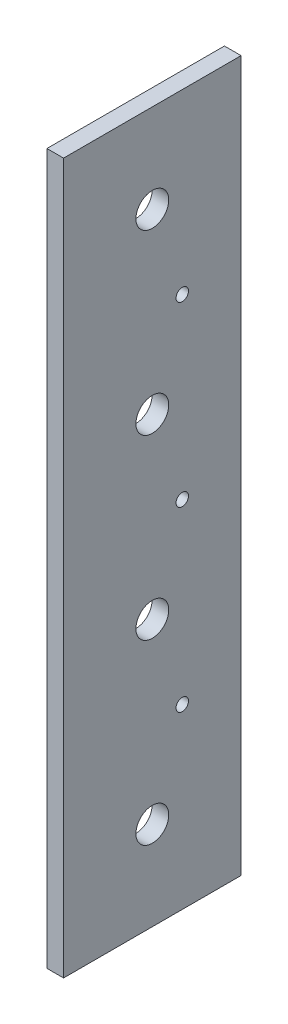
ISO-10303-21;
HEADER;
FILE_DESCRIPTION(('STEP AP214'),'2;1');
FILE_NAME('part.step','',(''),(''),'','','');
FILE_SCHEMA(('AUTOMOTIVE_DESIGN { 1 0 10303 214 1 1 1 1 }'));
ENDSEC;
DATA;
#1=APPLICATION_CONTEXT('core data for automotive mechanical design processes');
#2=APPLICATION_PROTOCOL_DEFINITION('international standard','automotive_design',2000,#1);
#3=PRODUCT_CONTEXT('',#1,'mechanical');
#4=PRODUCT('Part','Part','',(#3));
#5=PRODUCT_RELATED_PRODUCT_CATEGORY('part','',(#4));
#6=PRODUCT_DEFINITION_FORMATION('','',#4);
#7=PRODUCT_DEFINITION_CONTEXT('part definition',#1,'design');
#8=PRODUCT_DEFINITION('design','',#6,#7);
#9=PRODUCT_DEFINITION_SHAPE('','',#8);
#10=(LENGTH_UNIT() NAMED_UNIT(*) SI_UNIT(.MILLI.,.METRE.));
#11=(NAMED_UNIT(*) PLANE_ANGLE_UNIT() SI_UNIT($,.RADIAN.));
#12=(NAMED_UNIT(*) SI_UNIT($,.STERADIAN.) SOLID_ANGLE_UNIT());
#13=UNCERTAINTY_MEASURE_WITH_UNIT(LENGTH_MEASURE(1.E-05),#10,'distance_accuracy_value','');
#14=(GEOMETRIC_REPRESENTATION_CONTEXT(3) GLOBAL_UNCERTAINTY_ASSIGNED_CONTEXT((#13)) GLOBAL_UNIT_ASSIGNED_CONTEXT((#10,
#11,#12)) REPRESENTATION_CONTEXT('',''));
#15=CARTESIAN_POINT('',(0.,0.,0.));
#16=DIRECTION('',(0.,0.,1.));
#17=DIRECTION('',(1.,0.,0.));
#18=AXIS2_PLACEMENT_3D('',#15,#16,#17);
#19=CARTESIAN_POINT('',(4.7625,-101.6,-25.4));
#20=DIRECTION('',(0.,0.,1.));
#21=DIRECTION('',(1.,0.,0.));
#22=AXIS2_PLACEMENT_3D('',#19,#20,#21);
#23=PLANE('',#22);
#24=DIRECTION('',(0.,1.,0.));
#25=VECTOR('',#24,1.);
#26=CARTESIAN_POINT('',(0.,-101.6,-25.4));
#27=LINE('',#26,#25);
#28=CARTESIAN_POINT('',(0.,-101.6,-25.4));
#29=VERTEX_POINT('',#28);
#30=CARTESIAN_POINT('',(0.,101.6,-25.4));
#31=VERTEX_POINT('',#30);
#32=EDGE_CURVE('E98',#29,#31,#27,.T.);
#33=ORIENTED_EDGE('',*,*,#32,.T.);
#34=DIRECTION('',(-1.,0.,0.));
#35=VECTOR('',#34,1.);
#36=CARTESIAN_POINT('',(4.7625,101.6,-25.4));
#37=LINE('',#36,#35);
#38=CARTESIAN_POINT('',(4.7625,101.6,-25.4));
#39=VERTEX_POINT('',#38);
#40=EDGE_CURVE('E11',#39,#31,#37,.T.);
#41=ORIENTED_EDGE('',*,*,#40,.F.);
#42=DIRECTION('',(0.,1.,0.));
#43=VECTOR('',#42,1.);
#44=CARTESIAN_POINT('',(4.7625,-101.6,-25.4));
#45=LINE('',#44,#43);
#46=CARTESIAN_POINT('',(4.7625,-101.6,-25.4));
#47=VERTEX_POINT('',#46);
#48=EDGE_CURVE('E86',#47,#39,#45,.T.);
#49=ORIENTED_EDGE('',*,*,#48,.F.);
#50=DIRECTION('',(-1.,0.,0.));
#51=VECTOR('',#50,1.);
#52=CARTESIAN_POINT('',(4.7625,-101.6,-25.4));
#53=LINE('',#52,#51);
#54=EDGE_CURVE('E94',#47,#29,#53,.T.);
#55=ORIENTED_EDGE('',*,*,#54,.T.);
#56=EDGE_LOOP('',(#33,#41,#49,#55));
#57=FACE_BOUND('',#56,.T.);
#58=ADVANCED_FACE('F35',(#57),#23,.F.);
#59=CARTESIAN_POINT('',(4.7625,101.6,25.4));
#60=DIRECTION('',(0.,-1.,0.));
#61=DIRECTION('',(0.,0.,-1.));
#62=AXIS2_PLACEMENT_3D('',#59,#60,#61);
#63=PLANE('',#62);
#64=DIRECTION('',(0.,0.,1.));
#65=VECTOR('',#64,1.);
#66=CARTESIAN_POINT('',(0.,101.6,25.4));
#67=LINE('',#66,#65);
#68=CARTESIAN_POINT('',(0.,101.6,25.4));
#69=VERTEX_POINT('',#68);
#70=EDGE_CURVE('E90',#31,#69,#67,.T.);
#71=ORIENTED_EDGE('',*,*,#70,.T.);
#72=DIRECTION('',(-1.,0.,0.));
#73=VECTOR('',#72,1.);
#74=CARTESIAN_POINT('',(4.7625,101.6,25.4));
#75=LINE('',#74,#73);
#76=CARTESIAN_POINT('',(4.7625,101.6,25.4));
#77=VERTEX_POINT('',#76);
#78=EDGE_CURVE('E43',#77,#69,#75,.T.);
#79=ORIENTED_EDGE('',*,*,#78,.F.);
#80=DIRECTION('',(0.,0.,1.));
#81=VECTOR('',#80,1.);
#82=CARTESIAN_POINT('',(4.7625,101.6,25.4));
#83=LINE('',#82,#81);
#84=EDGE_CURVE('E81',#39,#77,#83,.T.);
#85=ORIENTED_EDGE('',*,*,#84,.F.);
#86=ORIENTED_EDGE('',*,*,#40,.T.);
#87=EDGE_LOOP('',(#71,#79,#85,#86));
#88=FACE_BOUND('',#87,.T.);
#89=ADVANCED_FACE('F89',(#88),#63,.F.);
#90=CARTESIAN_POINT('',(4.7625,-101.6,25.4));
#91=DIRECTION('',(0.,0.,-1.));
#92=DIRECTION('',(0.,1.,0.));
#93=AXIS2_PLACEMENT_3D('',#90,#91,#92);
#94=PLANE('',#93);
#95=DIRECTION('',(0.,-1.,0.));
#96=VECTOR('',#95,1.);
#97=CARTESIAN_POINT('',(0.,-101.6,25.4));
#98=LINE('',#97,#96);
#99=CARTESIAN_POINT('',(0.,-101.6,25.4));
#100=VERTEX_POINT('',#99);
#101=EDGE_CURVE('E68',#69,#100,#98,.T.);
#102=ORIENTED_EDGE('',*,*,#101,.T.);
#103=DIRECTION('',(-1.,0.,0.));
#104=VECTOR('',#103,1.);
#105=CARTESIAN_POINT('',(4.7625,-101.6,25.4));
#106=LINE('',#105,#104);
#107=CARTESIAN_POINT('',(4.7625,-101.6,25.4));
#108=VERTEX_POINT('',#107);
#109=EDGE_CURVE('E91',#108,#100,#106,.T.);
#110=ORIENTED_EDGE('',*,*,#109,.F.);
#111=DIRECTION('',(0.,-1.,0.));
#112=VECTOR('',#111,1.);
#113=CARTESIAN_POINT('',(4.7625,-101.6,25.4));
#114=LINE('',#113,#112);
#115=EDGE_CURVE('E84',#77,#108,#114,.T.);
#116=ORIENTED_EDGE('',*,*,#115,.F.);
#117=ORIENTED_EDGE('',*,*,#78,.T.);
#118=EDGE_LOOP('',(#102,#110,#116,#117));
#119=FACE_BOUND('',#118,.T.);
#120=ADVANCED_FACE('F92',(#119),#94,.F.);
#121=CARTESIAN_POINT('',(4.7625,-101.6,25.4));
#122=DIRECTION('',(0.,1.,0.));
#123=DIRECTION('',(0.,0.,1.));
#124=AXIS2_PLACEMENT_3D('',#121,#122,#123);
#125=PLANE('',#124);
#126=DIRECTION('',(0.,0.,-1.));
#127=VECTOR('',#126,1.);
#128=CARTESIAN_POINT('',(0.,-101.6,25.4));
#129=LINE('',#128,#127);
#130=EDGE_CURVE('E74',#100,#29,#129,.T.);
#131=ORIENTED_EDGE('',*,*,#130,.T.);
#132=ORIENTED_EDGE('',*,*,#54,.F.);
#133=DIRECTION('',(0.,0.,-1.));
#134=VECTOR('',#133,1.);
#135=CARTESIAN_POINT('',(4.7625,-101.6,25.4));
#136=LINE('',#135,#134);
#137=EDGE_CURVE('E51',#108,#47,#136,.T.);
#138=ORIENTED_EDGE('',*,*,#137,.F.);
#139=ORIENTED_EDGE('',*,*,#109,.T.);
#140=EDGE_LOOP('',(#131,#132,#138,#139));
#141=FACE_BOUND('',#140,.T.);
#142=ADVANCED_FACE('F106',(#141),#125,.F.);
#143=CARTESIAN_POINT('',(4.7625,0.,0.));
#144=DIRECTION('',(-1.,0.,0.));
#145=DIRECTION('',(0.,0.,1.));
#146=AXIS2_PLACEMENT_3D('',#143,#144,#145);
#147=PLANE('',#146);
#148=CARTESIAN_POINT('',(4.7625,-76.2000000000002,-2.54322395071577E-13));
#149=DIRECTION('',(-1.,0.,0.));
#150=DIRECTION('',(0.,0.,1.));
#151=AXIS2_PLACEMENT_3D('',#148,#149,#150);
#152=CIRCLE('',#151,4.69900000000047);
#153=CARTESIAN_POINT('',(4.7625,-76.2000000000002,4.69900000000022));
#154=VERTEX_POINT('',#153);
#155=EDGE_CURVE('E101',#154,#154,#152,.T.);
#156=ORIENTED_EDGE('',*,*,#155,.T.);
#157=EDGE_LOOP('',(#156));
#158=FACE_BOUND('',#157,.T.);
#159=CARTESIAN_POINT('',(4.7625,7.01413209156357E-11,-8.57249999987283));
#160=DIRECTION('',(-1.,0.,0.));
#161=DIRECTION('',(0.,0.,1.));
#162=AXIS2_PLACEMENT_3D('',#159,#160,#161);
#163=CIRCLE('',#162,1.77799999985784);
#164=CARTESIAN_POINT('',(4.7625,7.01413209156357E-11,-6.79450000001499));
#165=VERTEX_POINT('',#164);
#166=EDGE_CURVE('E141',#165,#165,#163,.T.);
#167=ORIENTED_EDGE('',*,*,#166,.T.);
#168=EDGE_LOOP('',(#167));
#169=FACE_BOUND('',#168,.T.);
#170=CARTESIAN_POINT('',(4.7625,50.8000000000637,-8.57249999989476));
#171=DIRECTION('',(-1.,0.,0.));
#172=DIRECTION('',(0.,0.,1.));
#173=AXIS2_PLACEMENT_3D('',#170,#171,#172);
#174=CIRCLE('',#173,1.77799999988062);
#175=CARTESIAN_POINT('',(4.7625,50.8000000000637,-6.79450000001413));
#176=VERTEX_POINT('',#175);
#177=EDGE_CURVE('E130',#176,#176,#174,.T.);
#178=ORIENTED_EDGE('',*,*,#177,.T.);
#179=EDGE_LOOP('',(#178));
#180=FACE_BOUND('',#179,.T.);
#181=CARTESIAN_POINT('',(4.7625,-25.4000000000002,-2.34045493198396E-13));
#182=DIRECTION('',(-1.,0.,0.));
#183=DIRECTION('',(0.,0.,1.));
#184=AXIS2_PLACEMENT_3D('',#181,#182,#183);
#185=CIRCLE('',#184,4.69900000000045);
#186=CARTESIAN_POINT('',(4.7625,-25.4000000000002,4.69900000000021));
#187=VERTEX_POINT('',#186);
#188=EDGE_CURVE('E122',#187,#187,#185,.T.);
#189=ORIENTED_EDGE('',*,*,#188,.T.);
#190=EDGE_LOOP('',(#189));
#191=FACE_BOUND('',#190,.T.);
#192=CARTESIAN_POINT('',(4.7625,25.3999999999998,-2.13768591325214E-13));
#193=DIRECTION('',(-1.,0.,0.));
#194=DIRECTION('',(0.,0.,1.));
#195=AXIS2_PLACEMENT_3D('',#192,#193,#194);
#196=CIRCLE('',#195,4.69900000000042);
#197=CARTESIAN_POINT('',(4.7625,25.3999999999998,4.69900000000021));
#198=VERTEX_POINT('',#197);
#199=EDGE_CURVE('E115',#198,#198,#196,.T.);
#200=ORIENTED_EDGE('',*,*,#199,.T.);
#201=EDGE_LOOP('',(#200));
#202=FACE_BOUND('',#201,.T.);
#203=CARTESIAN_POINT('',(4.7625,76.1999999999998,-1.94289029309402E-13));
#204=DIRECTION('',(-1.,0.,0.));
#205=DIRECTION('',(0.,0.,1.));
#206=AXIS2_PLACEMENT_3D('',#203,#204,#205);
#207=CIRCLE('',#206,4.69900000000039);
#208=CARTESIAN_POINT('',(4.7625,76.1999999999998,4.69900000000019));
#209=VERTEX_POINT('',#208);
#210=EDGE_CURVE('E116',#209,#209,#207,.T.);
#211=ORIENTED_EDGE('',*,*,#210,.T.);
#212=EDGE_LOOP('',(#211));
#213=FACE_BOUND('',#212,.T.);
#214=CARTESIAN_POINT('',(4.7625,-50.7999999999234,-8.57249999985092));
#215=DIRECTION('',(-1.,0.,0.));
#216=DIRECTION('',(0.,0.,1.));
#217=AXIS2_PLACEMENT_3D('',#214,#215,#216);
#218=CIRCLE('',#217,1.77799999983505);
#219=CARTESIAN_POINT('',(4.7625,-50.7999999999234,-6.79450000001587));
#220=VERTEX_POINT('',#219);
#221=EDGE_CURVE('E129',#220,#220,#218,.T.);
#222=ORIENTED_EDGE('',*,*,#221,.T.);
#223=EDGE_LOOP('',(#222));
#224=FACE_BOUND('',#223,.T.);
#225=ORIENTED_EDGE('',*,*,#48,.T.);
#226=ORIENTED_EDGE('',*,*,#84,.T.);
#227=ORIENTED_EDGE('',*,*,#115,.T.);
#228=ORIENTED_EDGE('',*,*,#137,.T.);
#229=EDGE_LOOP('',(#225,#226,#227,#228));
#230=FACE_BOUND('',#229,.T.);
#231=ADVANCED_FACE('F82',(#158,#169,#180,#191,#202,#213,#224,#230),#147,.F.);
#232=CARTESIAN_POINT('',(0.,0.,0.));
#233=DIRECTION('',(-1.,0.,0.));
#234=DIRECTION('',(0.,0.,1.));
#235=AXIS2_PLACEMENT_3D('',#232,#233,#234);
#236=PLANE('',#235);
#237=CARTESIAN_POINT('',(0.,-76.2000000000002,-2.54322395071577E-13));
#238=DIRECTION('',(-1.,0.,0.));
#239=DIRECTION('',(0.,0.,1.));
#240=AXIS2_PLACEMENT_3D('',#237,#238,#239);
#241=CIRCLE('',#240,4.69900000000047);
#242=CARTESIAN_POINT('',(0.,-76.2000000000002,4.69900000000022));
#243=VERTEX_POINT('',#242);
#244=EDGE_CURVE('E125',#243,#243,#241,.T.);
#245=ORIENTED_EDGE('',*,*,#244,.F.);
#246=EDGE_LOOP('',(#245));
#247=FACE_BOUND('',#246,.T.);
#248=CARTESIAN_POINT('',(0.,7.01413209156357E-11,-8.57249999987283));
#249=DIRECTION('',(-1.,0.,0.));
#250=DIRECTION('',(0.,0.,1.));
#251=AXIS2_PLACEMENT_3D('',#248,#249,#250);
#252=CIRCLE('',#251,1.77799999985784);
#253=CARTESIAN_POINT('',(0.,7.01413209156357E-11,-6.79450000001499));
#254=VERTEX_POINT('',#253);
#255=EDGE_CURVE('E138',#254,#254,#252,.T.);
#256=ORIENTED_EDGE('',*,*,#255,.F.);
#257=EDGE_LOOP('',(#256));
#258=FACE_BOUND('',#257,.T.);
#259=CARTESIAN_POINT('',(0.,50.8000000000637,-8.57249999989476));
#260=DIRECTION('',(-1.,0.,0.));
#261=DIRECTION('',(0.,0.,1.));
#262=AXIS2_PLACEMENT_3D('',#259,#260,#261);
#263=CIRCLE('',#262,1.77799999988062);
#264=CARTESIAN_POINT('',(0.,50.8000000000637,-6.79450000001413));
#265=VERTEX_POINT('',#264);
#266=EDGE_CURVE('E144',#265,#265,#263,.T.);
#267=ORIENTED_EDGE('',*,*,#266,.F.);
#268=EDGE_LOOP('',(#267));
#269=FACE_BOUND('',#268,.T.);
#270=CARTESIAN_POINT('',(0.,-25.4000000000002,-2.34045493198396E-13));
#271=DIRECTION('',(-1.,0.,0.));
#272=DIRECTION('',(0.,0.,1.));
#273=AXIS2_PLACEMENT_3D('',#270,#271,#272);
#274=CIRCLE('',#273,4.69900000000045);
#275=CARTESIAN_POINT('',(0.,-25.4000000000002,4.69900000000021));
#276=VERTEX_POINT('',#275);
#277=EDGE_CURVE('E119',#276,#276,#274,.T.);
#278=ORIENTED_EDGE('',*,*,#277,.F.);
#279=EDGE_LOOP('',(#278));
#280=FACE_BOUND('',#279,.T.);
#281=CARTESIAN_POINT('',(0.,25.3999999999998,-2.13768591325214E-13));
#282=DIRECTION('',(-1.,0.,0.));
#283=DIRECTION('',(0.,0.,1.));
#284=AXIS2_PLACEMENT_3D('',#281,#282,#283);
#285=CIRCLE('',#284,4.69900000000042);
#286=CARTESIAN_POINT('',(0.,25.3999999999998,4.69900000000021));
#287=VERTEX_POINT('',#286);
#288=EDGE_CURVE('E112',#287,#287,#285,.T.);
#289=ORIENTED_EDGE('',*,*,#288,.F.);
#290=EDGE_LOOP('',(#289));
#291=FACE_BOUND('',#290,.T.);
#292=CARTESIAN_POINT('',(0.,76.1999999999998,-1.94289029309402E-13));
#293=DIRECTION('',(-1.,0.,0.));
#294=DIRECTION('',(0.,0.,1.));
#295=AXIS2_PLACEMENT_3D('',#292,#293,#294);
#296=CIRCLE('',#295,4.69900000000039);
#297=CARTESIAN_POINT('',(0.,76.1999999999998,4.69900000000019));
#298=VERTEX_POINT('',#297);
#299=EDGE_CURVE('E133',#298,#298,#296,.T.);
#300=ORIENTED_EDGE('',*,*,#299,.F.);
#301=EDGE_LOOP('',(#300));
#302=FACE_BOUND('',#301,.T.);
#303=CARTESIAN_POINT('',(0.,-50.7999999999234,-8.57249999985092));
#304=DIRECTION('',(-1.,0.,0.));
#305=DIRECTION('',(0.,0.,1.));
#306=AXIS2_PLACEMENT_3D('',#303,#304,#305);
#307=CIRCLE('',#306,1.77799999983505);
#308=CARTESIAN_POINT('',(0.,-50.7999999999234,-6.79450000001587));
#309=VERTEX_POINT('',#308);
#310=EDGE_CURVE('E126',#309,#309,#307,.T.);
#311=ORIENTED_EDGE('',*,*,#310,.F.);
#312=EDGE_LOOP('',(#311));
#313=FACE_BOUND('',#312,.T.);
#314=ORIENTED_EDGE('',*,*,#32,.F.);
#315=ORIENTED_EDGE('',*,*,#130,.F.);
#316=ORIENTED_EDGE('',*,*,#101,.F.);
#317=ORIENTED_EDGE('',*,*,#70,.F.);
#318=EDGE_LOOP('',(#314,#315,#316,#317));
#319=FACE_BOUND('',#318,.T.);
#320=ADVANCED_FACE('F109',(#247,#258,#269,#280,#291,#302,#313,#319),#236,.T.);
#321=CARTESIAN_POINT('',(4.7625,-50.7999999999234,-8.57249999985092));
#322=DIRECTION('',(-1.,0.,0.));
#323=DIRECTION('',(0.,0.,1.));
#324=AXIS2_PLACEMENT_3D('',#321,#322,#323);
#325=CYLINDRICAL_SURFACE('',#324,1.77799999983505);
#326=CARTESIAN_POINT('',(4.7625,-50.7999999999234,-6.79450000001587));
#327=CARTESIAN_POINT('',(4.712890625,-50.7999999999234,-6.79450000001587));
#328=CARTESIAN_POINT('',(4.66328125,-50.7999999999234,-6.79450000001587));
#329=CARTESIAN_POINT('',(4.5640625,-50.7999999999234,-6.79450000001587));
#330=CARTESIAN_POINT('',(4.514453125,-50.7999999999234,-6.79450000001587));
#331=CARTESIAN_POINT('',(4.415234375,-50.7999999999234,-6.79450000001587));
#332=CARTESIAN_POINT('',(4.365625,-50.7999999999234,-6.79450000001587));
#333=CARTESIAN_POINT('',(4.26640625,-50.7999999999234,-6.79450000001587));
#334=CARTESIAN_POINT('',(4.216796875,-50.7999999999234,-6.79450000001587));
#335=CARTESIAN_POINT('',(4.117578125,-50.7999999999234,-6.79450000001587));
#336=CARTESIAN_POINT('',(4.06796875,-50.7999999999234,-6.79450000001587));
#337=CARTESIAN_POINT('',(3.96875,-50.7999999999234,-6.79450000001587));
#338=CARTESIAN_POINT('',(3.919140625,-50.7999999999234,-6.79450000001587));
#339=CARTESIAN_POINT('',(3.819921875,-50.7999999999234,-6.79450000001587));
#340=CARTESIAN_POINT('',(3.7703125,-50.7999999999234,-6.79450000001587));
#341=CARTESIAN_POINT('',(3.67109375,-50.7999999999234,-6.79450000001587));
#342=CARTESIAN_POINT('',(3.621484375,-50.7999999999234,-6.79450000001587));
#343=CARTESIAN_POINT('',(3.522265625,-50.7999999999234,-6.79450000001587));
#344=CARTESIAN_POINT('',(3.47265625,-50.7999999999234,-6.79450000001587));
#345=CARTESIAN_POINT('',(3.3734375,-50.7999999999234,-6.79450000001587));
#346=CARTESIAN_POINT('',(3.323828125,-50.7999999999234,-6.79450000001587));
#347=CARTESIAN_POINT('',(3.224609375,-50.7999999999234,-6.79450000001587));
#348=CARTESIAN_POINT('',(3.175,-50.7999999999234,-6.79450000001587));
#349=CARTESIAN_POINT('',(3.07578125,-50.7999999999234,-6.79450000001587));
#350=CARTESIAN_POINT('',(3.026171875,-50.7999999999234,-6.79450000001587));
#351=CARTESIAN_POINT('',(2.926953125,-50.7999999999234,-6.79450000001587));
#352=CARTESIAN_POINT('',(2.87734375,-50.7999999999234,-6.79450000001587));
#353=CARTESIAN_POINT('',(2.778125,-50.7999999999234,-6.79450000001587));
#354=CARTESIAN_POINT('',(2.728515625,-50.7999999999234,-6.79450000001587));
#355=CARTESIAN_POINT('',(2.629296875,-50.7999999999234,-6.79450000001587));
#356=CARTESIAN_POINT('',(2.5796875,-50.7999999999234,-6.79450000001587));
#357=CARTESIAN_POINT('',(2.48046875,-50.7999999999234,-6.79450000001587));
#358=CARTESIAN_POINT('',(2.430859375,-50.7999999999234,-6.79450000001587));
#359=CARTESIAN_POINT('',(2.331640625,-50.7999999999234,-6.79450000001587));
#360=CARTESIAN_POINT('',(2.28203125,-50.7999999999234,-6.79450000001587));
#361=CARTESIAN_POINT('',(2.1828125,-50.7999999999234,-6.79450000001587));
#362=CARTESIAN_POINT('',(2.133203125,-50.7999999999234,-6.79450000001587));
#363=CARTESIAN_POINT('',(2.033984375,-50.7999999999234,-6.79450000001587));
#364=CARTESIAN_POINT('',(1.984375,-50.7999999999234,-6.79450000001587));
#365=CARTESIAN_POINT('',(1.88515625,-50.7999999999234,-6.79450000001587));
#366=CARTESIAN_POINT('',(1.835546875,-50.7999999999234,-6.79450000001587));
#367=CARTESIAN_POINT('',(1.736328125,-50.7999999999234,-6.79450000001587));
#368=CARTESIAN_POINT('',(1.68671875,-50.7999999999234,-6.79450000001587));
#369=CARTESIAN_POINT('',(1.5875,-50.7999999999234,-6.79450000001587));
#370=CARTESIAN_POINT('',(1.537890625,-50.7999999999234,-6.79450000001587));
#371=CARTESIAN_POINT('',(1.438671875,-50.7999999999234,-6.79450000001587));
#372=CARTESIAN_POINT('',(1.3890625,-50.7999999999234,-6.79450000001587));
#373=CARTESIAN_POINT('',(1.28984375,-50.7999999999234,-6.79450000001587));
#374=CARTESIAN_POINT('',(1.240234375,-50.7999999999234,-6.79450000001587));
#375=CARTESIAN_POINT('',(1.141015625,-50.7999999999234,-6.79450000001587));
#376=CARTESIAN_POINT('',(1.09140625,-50.7999999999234,-6.79450000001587));
#377=CARTESIAN_POINT('',(0.9921875,-50.7999999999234,-6.79450000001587));
#378=CARTESIAN_POINT('',(0.942578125,-50.7999999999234,-6.79450000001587));
#379=CARTESIAN_POINT('',(0.843359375,-50.7999999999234,-6.79450000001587));
#380=CARTESIAN_POINT('',(0.79375,-50.7999999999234,-6.79450000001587));
#381=CARTESIAN_POINT('',(0.69453125,-50.7999999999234,-6.79450000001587));
#382=CARTESIAN_POINT('',(0.644921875,-50.7999999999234,-6.79450000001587));
#383=CARTESIAN_POINT('',(0.545703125,-50.7999999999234,-6.79450000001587));
#384=CARTESIAN_POINT('',(0.49609375,-50.7999999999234,-6.79450000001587));
#385=CARTESIAN_POINT('',(0.396875,-50.7999999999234,-6.79450000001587));
#386=CARTESIAN_POINT('',(0.347265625,-50.7999999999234,-6.79450000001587));
#387=CARTESIAN_POINT('',(0.248046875,-50.7999999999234,-6.79450000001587));
#388=CARTESIAN_POINT('',(0.1984375,-50.7999999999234,-6.79450000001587));
#389=CARTESIAN_POINT('',(0.09921875,-50.7999999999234,-6.79450000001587));
#390=CARTESIAN_POINT('',(0.049609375,-50.7999999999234,-6.79450000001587));
#391=CARTESIAN_POINT('',(0.,-50.7999999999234,-6.79450000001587));
#392=B_SPLINE_CURVE_WITH_KNOTS('',3,(#326,#327,#328,#329,#330,#331,#332,#333,#334,#335,#336,
#337,#338,#339,#340,#341,#342,#343,#344,#345,#346,#347,#348,#349,#350,#351,#352,#353,#354,#355,
#356,#357,#358,#359,#360,#361,#362,#363,#364,#365,#366,#367,#368,#369,#370,#371,#372,#373,#374,
#375,#376,#377,#378,#379,#380,#381,#382,#383,#384,#385,#386,#387,#388,#389,#390,#391),
.UNSPECIFIED.,.F.,.F.,(4,2,2,2,2,2,2,2,2,2,2,2,2,2,2,2,2,2,2,2,2,2,2,2,2,2,2,2,2,2,2,2,4),(0.,
0.148828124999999,0.297656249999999,0.446484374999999,0.595312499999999,0.744140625,0.89296875,
1.041796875,1.190625,1.339453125,1.48828125,1.637109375,1.7859375,1.934765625,2.08359375,
2.232421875,2.38125,2.530078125,2.67890625,2.827734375,2.9765625,3.125390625,3.27421875,
3.423046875,3.571875,3.720703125,3.86953125,4.018359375,4.1671875,4.316015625,4.46484375,
4.613671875,4.7625),.UNSPECIFIED.);
#393=EDGE_CURVE('BSEAM165',#220,#309,#392,.T.);
#394=ORIENTED_EDGE('',*,*,#221,.F.);
#395=ORIENTED_EDGE('',*,*,#310,.T.);
#396=ORIENTED_EDGE('',*,*,#393,.T.);
#397=ORIENTED_EDGE('',*,*,#393,.F.);
#398=EDGE_LOOP('',(#394,#396,#395,#397));
#399=FACE_BOUND('',#398,.T.);
#400=ADVANCED_FACE('F165',(#399),#325,.F.);
#401=CARTESIAN_POINT('',(4.7625,76.1999999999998,-1.94289029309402E-13));
#402=DIRECTION('',(-1.,0.,0.));
#403=DIRECTION('',(0.,0.,1.));
#404=AXIS2_PLACEMENT_3D('',#401,#402,#403);
#405=CYLINDRICAL_SURFACE('',#404,4.69900000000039);
#406=CARTESIAN_POINT('',(4.7625,76.1999999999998,4.69900000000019));
#407=CARTESIAN_POINT('',(4.712890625,76.1999999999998,4.69900000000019));
#408=CARTESIAN_POINT('',(4.66328125,76.1999999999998,4.69900000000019));
#409=CARTESIAN_POINT('',(4.5640625,76.1999999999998,4.69900000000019));
#410=CARTESIAN_POINT('',(4.514453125,76.1999999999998,4.69900000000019));
#411=CARTESIAN_POINT('',(4.415234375,76.1999999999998,4.69900000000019));
#412=CARTESIAN_POINT('',(4.365625,76.1999999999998,4.69900000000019));
#413=CARTESIAN_POINT('',(4.26640625,76.1999999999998,4.69900000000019));
#414=CARTESIAN_POINT('',(4.216796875,76.1999999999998,4.69900000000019));
#415=CARTESIAN_POINT('',(4.117578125,76.1999999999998,4.69900000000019));
#416=CARTESIAN_POINT('',(4.06796875,76.1999999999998,4.69900000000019));
#417=CARTESIAN_POINT('',(3.96875,76.1999999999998,4.69900000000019));
#418=CARTESIAN_POINT('',(3.919140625,76.1999999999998,4.69900000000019));
#419=CARTESIAN_POINT('',(3.819921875,76.1999999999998,4.69900000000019));
#420=CARTESIAN_POINT('',(3.7703125,76.1999999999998,4.69900000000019));
#421=CARTESIAN_POINT('',(3.67109375,76.1999999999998,4.69900000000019));
#422=CARTESIAN_POINT('',(3.621484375,76.1999999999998,4.69900000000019));
#423=CARTESIAN_POINT('',(3.522265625,76.1999999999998,4.69900000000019));
#424=CARTESIAN_POINT('',(3.47265625,76.1999999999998,4.69900000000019));
#425=CARTESIAN_POINT('',(3.3734375,76.1999999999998,4.69900000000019));
#426=CARTESIAN_POINT('',(3.323828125,76.1999999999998,4.69900000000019));
#427=CARTESIAN_POINT('',(3.224609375,76.1999999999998,4.69900000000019));
#428=CARTESIAN_POINT('',(3.175,76.1999999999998,4.69900000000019));
#429=CARTESIAN_POINT('',(3.07578125,76.1999999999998,4.69900000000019));
#430=CARTESIAN_POINT('',(3.026171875,76.1999999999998,4.69900000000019));
#431=CARTESIAN_POINT('',(2.926953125,76.1999999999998,4.69900000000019));
#432=CARTESIAN_POINT('',(2.87734375,76.1999999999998,4.69900000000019));
#433=CARTESIAN_POINT('',(2.778125,76.1999999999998,4.69900000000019));
#434=CARTESIAN_POINT('',(2.728515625,76.1999999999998,4.69900000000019));
#435=CARTESIAN_POINT('',(2.629296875,76.1999999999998,4.69900000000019));
#436=CARTESIAN_POINT('',(2.5796875,76.1999999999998,4.69900000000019));
#437=CARTESIAN_POINT('',(2.48046875,76.1999999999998,4.69900000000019));
#438=CARTESIAN_POINT('',(2.430859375,76.1999999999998,4.69900000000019));
#439=CARTESIAN_POINT('',(2.331640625,76.1999999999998,4.69900000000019));
#440=CARTESIAN_POINT('',(2.28203125,76.1999999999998,4.69900000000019));
#441=CARTESIAN_POINT('',(2.1828125,76.1999999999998,4.69900000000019));
#442=CARTESIAN_POINT('',(2.133203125,76.1999999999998,4.69900000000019));
#443=CARTESIAN_POINT('',(2.033984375,76.1999999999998,4.69900000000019));
#444=CARTESIAN_POINT('',(1.984375,76.1999999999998,4.69900000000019));
#445=CARTESIAN_POINT('',(1.88515625,76.1999999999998,4.69900000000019));
#446=CARTESIAN_POINT('',(1.835546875,76.1999999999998,4.69900000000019));
#447=CARTESIAN_POINT('',(1.736328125,76.1999999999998,4.69900000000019));
#448=CARTESIAN_POINT('',(1.68671875,76.1999999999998,4.69900000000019));
#449=CARTESIAN_POINT('',(1.5875,76.1999999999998,4.69900000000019));
#450=CARTESIAN_POINT('',(1.537890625,76.1999999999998,4.69900000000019));
#451=CARTESIAN_POINT('',(1.438671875,76.1999999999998,4.69900000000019));
#452=CARTESIAN_POINT('',(1.3890625,76.1999999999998,4.69900000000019));
#453=CARTESIAN_POINT('',(1.28984375,76.1999999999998,4.69900000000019));
#454=CARTESIAN_POINT('',(1.240234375,76.1999999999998,4.69900000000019));
#455=CARTESIAN_POINT('',(1.141015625,76.1999999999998,4.69900000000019));
#456=CARTESIAN_POINT('',(1.09140625,76.1999999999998,4.69900000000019));
#457=CARTESIAN_POINT('',(0.9921875,76.1999999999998,4.69900000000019));
#458=CARTESIAN_POINT('',(0.942578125,76.1999999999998,4.69900000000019));
#459=CARTESIAN_POINT('',(0.843359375,76.1999999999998,4.69900000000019));
#460=CARTESIAN_POINT('',(0.79375,76.1999999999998,4.69900000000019));
#461=CARTESIAN_POINT('',(0.69453125,76.1999999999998,4.69900000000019));
#462=CARTESIAN_POINT('',(0.644921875,76.1999999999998,4.69900000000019));
#463=CARTESIAN_POINT('',(0.545703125,76.1999999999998,4.69900000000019));
#464=CARTESIAN_POINT('',(0.49609375,76.1999999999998,4.69900000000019));
#465=CARTESIAN_POINT('',(0.396875,76.1999999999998,4.69900000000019));
#466=CARTESIAN_POINT('',(0.347265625,76.1999999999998,4.69900000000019));
#467=CARTESIAN_POINT('',(0.248046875,76.1999999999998,4.69900000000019));
#468=CARTESIAN_POINT('',(0.1984375,76.1999999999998,4.69900000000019));
#469=CARTESIAN_POINT('',(0.09921875,76.1999999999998,4.69900000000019));
#470=CARTESIAN_POINT('',(0.049609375,76.1999999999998,4.69900000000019));
#471=CARTESIAN_POINT('',(0.,76.1999999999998,4.69900000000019));
#472=B_SPLINE_CURVE_WITH_KNOTS('',3,(#406,#407,#408,#409,#410,#411,#412,#413,#414,#415,#416,
#417,#418,#419,#420,#421,#422,#423,#424,#425,#426,#427,#428,#429,#430,#431,#432,#433,#434,#435,
#436,#437,#438,#439,#440,#441,#442,#443,#444,#445,#446,#447,#448,#449,#450,#451,#452,#453,#454,
#455,#456,#457,#458,#459,#460,#461,#462,#463,#464,#465,#466,#467,#468,#469,#470,#471),
.UNSPECIFIED.,.F.,.F.,(4,2,2,2,2,2,2,2,2,2,2,2,2,2,2,2,2,2,2,2,2,2,2,2,2,2,2,2,2,2,2,2,4),(0.,
0.148828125,0.29765625,0.446484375,0.5953125,0.744140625,0.892968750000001,1.041796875,1.190625,
1.339453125,1.48828125,1.637109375,1.7859375,1.934765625,2.08359375,2.232421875,2.38125,
2.530078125,2.67890625,2.827734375,2.9765625,3.125390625,3.27421875,3.423046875,3.571875,
3.720703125,3.86953125,4.018359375,4.1671875,4.316015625,4.46484375,4.613671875,4.7625),.UNSPECIFIED.);
#473=EDGE_CURVE('BSEAM180',#209,#298,#472,.T.);
#474=ORIENTED_EDGE('',*,*,#210,.F.);
#475=ORIENTED_EDGE('',*,*,#299,.T.);
#476=ORIENTED_EDGE('',*,*,#473,.T.);
#477=ORIENTED_EDGE('',*,*,#473,.F.);
#478=EDGE_LOOP('',(#474,#476,#475,#477));
#479=FACE_BOUND('',#478,.T.);
#480=ADVANCED_FACE('F180',(#479),#405,.F.);
#481=CARTESIAN_POINT('',(4.7625,25.3999999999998,-2.13768591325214E-13));
#482=DIRECTION('',(-1.,0.,0.));
#483=DIRECTION('',(0.,0.,1.));
#484=AXIS2_PLACEMENT_3D('',#481,#482,#483);
#485=CYLINDRICAL_SURFACE('',#484,4.69900000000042);
#486=CARTESIAN_POINT('',(4.7625,25.3999999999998,4.69900000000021));
#487=CARTESIAN_POINT('',(4.712890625,25.3999999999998,4.69900000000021));
#488=CARTESIAN_POINT('',(4.66328125,25.3999999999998,4.69900000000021));
#489=CARTESIAN_POINT('',(4.5640625,25.3999999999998,4.69900000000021));
#490=CARTESIAN_POINT('',(4.514453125,25.3999999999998,4.69900000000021));
#491=CARTESIAN_POINT('',(4.415234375,25.3999999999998,4.69900000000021));
#492=CARTESIAN_POINT('',(4.365625,25.3999999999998,4.69900000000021));
#493=CARTESIAN_POINT('',(4.26640625,25.3999999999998,4.69900000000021));
#494=CARTESIAN_POINT('',(4.216796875,25.3999999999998,4.69900000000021));
#495=CARTESIAN_POINT('',(4.117578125,25.3999999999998,4.69900000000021));
#496=CARTESIAN_POINT('',(4.06796875,25.3999999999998,4.69900000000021));
#497=CARTESIAN_POINT('',(3.96875,25.3999999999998,4.69900000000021));
#498=CARTESIAN_POINT('',(3.919140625,25.3999999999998,4.69900000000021));
#499=CARTESIAN_POINT('',(3.819921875,25.3999999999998,4.69900000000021));
#500=CARTESIAN_POINT('',(3.7703125,25.3999999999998,4.69900000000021));
#501=CARTESIAN_POINT('',(3.67109375,25.3999999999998,4.69900000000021));
#502=CARTESIAN_POINT('',(3.621484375,25.3999999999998,4.69900000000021));
#503=CARTESIAN_POINT('',(3.522265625,25.3999999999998,4.69900000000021));
#504=CARTESIAN_POINT('',(3.47265625,25.3999999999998,4.69900000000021));
#505=CARTESIAN_POINT('',(3.3734375,25.3999999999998,4.69900000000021));
#506=CARTESIAN_POINT('',(3.323828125,25.3999999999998,4.69900000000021));
#507=CARTESIAN_POINT('',(3.224609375,25.3999999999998,4.69900000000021));
#508=CARTESIAN_POINT('',(3.175,25.3999999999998,4.69900000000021));
#509=CARTESIAN_POINT('',(3.07578125,25.3999999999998,4.69900000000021));
#510=CARTESIAN_POINT('',(3.026171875,25.3999999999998,4.69900000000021));
#511=CARTESIAN_POINT('',(2.926953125,25.3999999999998,4.69900000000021));
#512=CARTESIAN_POINT('',(2.87734375,25.3999999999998,4.69900000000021));
#513=CARTESIAN_POINT('',(2.778125,25.3999999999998,4.69900000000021));
#514=CARTESIAN_POINT('',(2.728515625,25.3999999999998,4.69900000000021));
#515=CARTESIAN_POINT('',(2.629296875,25.3999999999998,4.69900000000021));
#516=CARTESIAN_POINT('',(2.5796875,25.3999999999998,4.69900000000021));
#517=CARTESIAN_POINT('',(2.48046875,25.3999999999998,4.69900000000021));
#518=CARTESIAN_POINT('',(2.430859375,25.3999999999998,4.69900000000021));
#519=CARTESIAN_POINT('',(2.331640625,25.3999999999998,4.69900000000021));
#520=CARTESIAN_POINT('',(2.28203125,25.3999999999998,4.69900000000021));
#521=CARTESIAN_POINT('',(2.1828125,25.3999999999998,4.69900000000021));
#522=CARTESIAN_POINT('',(2.133203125,25.3999999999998,4.69900000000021));
#523=CARTESIAN_POINT('',(2.033984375,25.3999999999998,4.69900000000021));
#524=CARTESIAN_POINT('',(1.984375,25.3999999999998,4.69900000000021));
#525=CARTESIAN_POINT('',(1.88515625,25.3999999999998,4.69900000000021));
#526=CARTESIAN_POINT('',(1.835546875,25.3999999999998,4.69900000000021));
#527=CARTESIAN_POINT('',(1.736328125,25.3999999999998,4.69900000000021));
#528=CARTESIAN_POINT('',(1.68671875,25.3999999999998,4.69900000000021));
#529=CARTESIAN_POINT('',(1.5875,25.3999999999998,4.69900000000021));
#530=CARTESIAN_POINT('',(1.537890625,25.3999999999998,4.69900000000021));
#531=CARTESIAN_POINT('',(1.438671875,25.3999999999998,4.69900000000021));
#532=CARTESIAN_POINT('',(1.3890625,25.3999999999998,4.69900000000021));
#533=CARTESIAN_POINT('',(1.28984375,25.3999999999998,4.69900000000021));
#534=CARTESIAN_POINT('',(1.240234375,25.3999999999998,4.69900000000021));
#535=CARTESIAN_POINT('',(1.141015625,25.3999999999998,4.69900000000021));
#536=CARTESIAN_POINT('',(1.09140625,25.3999999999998,4.69900000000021));
#537=CARTESIAN_POINT('',(0.9921875,25.3999999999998,4.69900000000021));
#538=CARTESIAN_POINT('',(0.942578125,25.3999999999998,4.69900000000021));
#539=CARTESIAN_POINT('',(0.843359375,25.3999999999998,4.69900000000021));
#540=CARTESIAN_POINT('',(0.79375,25.3999999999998,4.69900000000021));
#541=CARTESIAN_POINT('',(0.69453125,25.3999999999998,4.69900000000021));
#542=CARTESIAN_POINT('',(0.644921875,25.3999999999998,4.69900000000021));
#543=CARTESIAN_POINT('',(0.545703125,25.3999999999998,4.69900000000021));
#544=CARTESIAN_POINT('',(0.49609375,25.3999999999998,4.69900000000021));
#545=CARTESIAN_POINT('',(0.396875,25.3999999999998,4.69900000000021));
#546=CARTESIAN_POINT('',(0.347265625,25.3999999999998,4.69900000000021));
#547=CARTESIAN_POINT('',(0.248046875,25.3999999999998,4.69900000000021));
#548=CARTESIAN_POINT('',(0.1984375,25.3999999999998,4.69900000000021));
#549=CARTESIAN_POINT('',(0.09921875,25.3999999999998,4.69900000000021));
#550=CARTESIAN_POINT('',(0.049609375,25.3999999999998,4.69900000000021));
#551=CARTESIAN_POINT('',(0.,25.3999999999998,4.69900000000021));
#552=B_SPLINE_CURVE_WITH_KNOTS('',3,(#486,#487,#488,#489,#490,#491,#492,#493,#494,#495,#496,
#497,#498,#499,#500,#501,#502,#503,#504,#505,#506,#507,#508,#509,#510,#511,#512,#513,#514,#515,
#516,#517,#518,#519,#520,#521,#522,#523,#524,#525,#526,#527,#528,#529,#530,#531,#532,#533,#534,
#535,#536,#537,#538,#539,#540,#541,#542,#543,#544,#545,#546,#547,#548,#549,#550,#551),
.UNSPECIFIED.,.F.,.F.,(4,2,2,2,2,2,2,2,2,2,2,2,2,2,2,2,2,2,2,2,2,2,2,2,2,2,2,2,2,2,2,2,4),(0.,
0.148828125,0.29765625,0.446484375,0.5953125,0.744140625,0.892968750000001,1.041796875,1.190625,
1.339453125,1.48828125,1.637109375,1.7859375,1.934765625,2.08359375,2.232421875,2.38125,
2.530078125,2.67890625,2.827734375,2.9765625,3.125390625,3.27421875,3.423046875,3.571875,
3.720703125,3.86953125,4.018359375,4.1671875,4.316015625,4.46484375,4.613671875,4.7625),.UNSPECIFIED.);
#553=EDGE_CURVE('BSEAM187',#198,#287,#552,.T.);
#554=ORIENTED_EDGE('',*,*,#199,.F.);
#555=ORIENTED_EDGE('',*,*,#288,.T.);
#556=ORIENTED_EDGE('',*,*,#553,.T.);
#557=ORIENTED_EDGE('',*,*,#553,.F.);
#558=EDGE_LOOP('',(#554,#556,#555,#557));
#559=FACE_BOUND('',#558,.T.);
#560=ADVANCED_FACE('F187',(#559),#485,.F.);
#561=CARTESIAN_POINT('',(4.7625,-25.4000000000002,-2.34045493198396E-13));
#562=DIRECTION('',(-1.,0.,0.));
#563=DIRECTION('',(0.,0.,1.));
#564=AXIS2_PLACEMENT_3D('',#561,#562,#563);
#565=CYLINDRICAL_SURFACE('',#564,4.69900000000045);
#566=CARTESIAN_POINT('',(4.7625,-25.4000000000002,4.69900000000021));
#567=CARTESIAN_POINT('',(4.712890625,-25.4000000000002,4.69900000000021));
#568=CARTESIAN_POINT('',(4.66328125,-25.4000000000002,4.69900000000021));
#569=CARTESIAN_POINT('',(4.5640625,-25.4000000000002,4.69900000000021));
#570=CARTESIAN_POINT('',(4.514453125,-25.4000000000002,4.69900000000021));
#571=CARTESIAN_POINT('',(4.415234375,-25.4000000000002,4.69900000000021));
#572=CARTESIAN_POINT('',(4.365625,-25.4000000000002,4.69900000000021));
#573=CARTESIAN_POINT('',(4.26640625,-25.4000000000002,4.69900000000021));
#574=CARTESIAN_POINT('',(4.216796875,-25.4000000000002,4.69900000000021));
#575=CARTESIAN_POINT('',(4.117578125,-25.4000000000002,4.69900000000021));
#576=CARTESIAN_POINT('',(4.06796875,-25.4000000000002,4.69900000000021));
#577=CARTESIAN_POINT('',(3.96875,-25.4000000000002,4.69900000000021));
#578=CARTESIAN_POINT('',(3.919140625,-25.4000000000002,4.69900000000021));
#579=CARTESIAN_POINT('',(3.819921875,-25.4000000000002,4.69900000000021));
#580=CARTESIAN_POINT('',(3.7703125,-25.4000000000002,4.69900000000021));
#581=CARTESIAN_POINT('',(3.67109375,-25.4000000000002,4.69900000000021));
#582=CARTESIAN_POINT('',(3.621484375,-25.4000000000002,4.69900000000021));
#583=CARTESIAN_POINT('',(3.522265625,-25.4000000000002,4.69900000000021));
#584=CARTESIAN_POINT('',(3.47265625,-25.4000000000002,4.69900000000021));
#585=CARTESIAN_POINT('',(3.3734375,-25.4000000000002,4.69900000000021));
#586=CARTESIAN_POINT('',(3.323828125,-25.4000000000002,4.69900000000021));
#587=CARTESIAN_POINT('',(3.224609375,-25.4000000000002,4.69900000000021));
#588=CARTESIAN_POINT('',(3.175,-25.4000000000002,4.69900000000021));
#589=CARTESIAN_POINT('',(3.07578125,-25.4000000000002,4.69900000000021));
#590=CARTESIAN_POINT('',(3.026171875,-25.4000000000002,4.69900000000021));
#591=CARTESIAN_POINT('',(2.926953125,-25.4000000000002,4.69900000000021));
#592=CARTESIAN_POINT('',(2.87734375,-25.4000000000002,4.69900000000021));
#593=CARTESIAN_POINT('',(2.778125,-25.4000000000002,4.69900000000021));
#594=CARTESIAN_POINT('',(2.728515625,-25.4000000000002,4.69900000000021));
#595=CARTESIAN_POINT('',(2.629296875,-25.4000000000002,4.69900000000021));
#596=CARTESIAN_POINT('',(2.5796875,-25.4000000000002,4.69900000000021));
#597=CARTESIAN_POINT('',(2.48046875,-25.4000000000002,4.69900000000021));
#598=CARTESIAN_POINT('',(2.430859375,-25.4000000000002,4.69900000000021));
#599=CARTESIAN_POINT('',(2.331640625,-25.4000000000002,4.69900000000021));
#600=CARTESIAN_POINT('',(2.28203125,-25.4000000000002,4.69900000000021));
#601=CARTESIAN_POINT('',(2.1828125,-25.4000000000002,4.69900000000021));
#602=CARTESIAN_POINT('',(2.133203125,-25.4000000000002,4.69900000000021));
#603=CARTESIAN_POINT('',(2.033984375,-25.4000000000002,4.69900000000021));
#604=CARTESIAN_POINT('',(1.984375,-25.4000000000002,4.69900000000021));
#605=CARTESIAN_POINT('',(1.88515625,-25.4000000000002,4.69900000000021));
#606=CARTESIAN_POINT('',(1.835546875,-25.4000000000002,4.69900000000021));
#607=CARTESIAN_POINT('',(1.736328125,-25.4000000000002,4.69900000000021));
#608=CARTESIAN_POINT('',(1.68671875,-25.4000000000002,4.69900000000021));
#609=CARTESIAN_POINT('',(1.5875,-25.4000000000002,4.69900000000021));
#610=CARTESIAN_POINT('',(1.537890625,-25.4000000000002,4.69900000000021));
#611=CARTESIAN_POINT('',(1.438671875,-25.4000000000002,4.69900000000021));
#612=CARTESIAN_POINT('',(1.3890625,-25.4000000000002,4.69900000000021));
#613=CARTESIAN_POINT('',(1.28984375,-25.4000000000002,4.69900000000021));
#614=CARTESIAN_POINT('',(1.240234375,-25.4000000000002,4.69900000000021));
#615=CARTESIAN_POINT('',(1.141015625,-25.4000000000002,4.69900000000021));
#616=CARTESIAN_POINT('',(1.09140625,-25.4000000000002,4.69900000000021));
#617=CARTESIAN_POINT('',(0.9921875,-25.4000000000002,4.69900000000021));
#618=CARTESIAN_POINT('',(0.942578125,-25.4000000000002,4.69900000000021));
#619=CARTESIAN_POINT('',(0.843359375,-25.4000000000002,4.69900000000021));
#620=CARTESIAN_POINT('',(0.79375,-25.4000000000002,4.69900000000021));
#621=CARTESIAN_POINT('',(0.69453125,-25.4000000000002,4.69900000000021));
#622=CARTESIAN_POINT('',(0.644921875,-25.4000000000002,4.69900000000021));
#623=CARTESIAN_POINT('',(0.545703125,-25.4000000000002,4.69900000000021));
#624=CARTESIAN_POINT('',(0.49609375,-25.4000000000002,4.69900000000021));
#625=CARTESIAN_POINT('',(0.396875,-25.4000000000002,4.69900000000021));
#626=CARTESIAN_POINT('',(0.347265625,-25.4000000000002,4.69900000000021));
#627=CARTESIAN_POINT('',(0.248046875,-25.4000000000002,4.69900000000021));
#628=CARTESIAN_POINT('',(0.1984375,-25.4000000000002,4.69900000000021));
#629=CARTESIAN_POINT('',(0.09921875,-25.4000000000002,4.69900000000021));
#630=CARTESIAN_POINT('',(0.049609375,-25.4000000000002,4.69900000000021));
#631=CARTESIAN_POINT('',(0.,-25.4000000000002,4.69900000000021));
#632=B_SPLINE_CURVE_WITH_KNOTS('',3,(#566,#567,#568,#569,#570,#571,#572,#573,#574,#575,#576,
#577,#578,#579,#580,#581,#582,#583,#584,#585,#586,#587,#588,#589,#590,#591,#592,#593,#594,#595,
#596,#597,#598,#599,#600,#601,#602,#603,#604,#605,#606,#607,#608,#609,#610,#611,#612,#613,#614,
#615,#616,#617,#618,#619,#620,#621,#622,#623,#624,#625,#626,#627,#628,#629,#630,#631),
.UNSPECIFIED.,.F.,.F.,(4,2,2,2,2,2,2,2,2,2,2,2,2,2,2,2,2,2,2,2,2,2,2,2,2,2,2,2,2,2,2,2,4),(0.,
0.148828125,0.29765625,0.446484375,0.5953125,0.744140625,0.892968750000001,1.041796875,1.190625,
1.339453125,1.48828125,1.637109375,1.7859375,1.934765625,2.08359375,2.232421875,2.38125,
2.530078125,2.67890625,2.827734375,2.9765625,3.125390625,3.27421875,3.423046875,3.571875,
3.720703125,3.86953125,4.018359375,4.1671875,4.316015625,4.46484375,4.613671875,4.7625),.UNSPECIFIED.);
#633=EDGE_CURVE('BSEAM206',#187,#276,#632,.T.);
#634=ORIENTED_EDGE('',*,*,#188,.F.);
#635=ORIENTED_EDGE('',*,*,#277,.T.);
#636=ORIENTED_EDGE('',*,*,#633,.T.);
#637=ORIENTED_EDGE('',*,*,#633,.F.);
#638=EDGE_LOOP('',(#634,#636,#635,#637));
#639=FACE_BOUND('',#638,.T.);
#640=ADVANCED_FACE('F206',(#639),#565,.F.);
#641=CARTESIAN_POINT('',(4.7625,50.8000000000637,-8.57249999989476));
#642=DIRECTION('',(-1.,0.,0.));
#643=DIRECTION('',(0.,0.,1.));
#644=AXIS2_PLACEMENT_3D('',#641,#642,#643);
#645=CYLINDRICAL_SURFACE('',#644,1.77799999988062);
#646=CARTESIAN_POINT('',(4.7625,50.8000000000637,-6.79450000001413));
#647=CARTESIAN_POINT('',(4.712890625,50.8000000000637,-6.79450000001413));
#648=CARTESIAN_POINT('',(4.66328125,50.8000000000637,-6.79450000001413));
#649=CARTESIAN_POINT('',(4.5640625,50.8000000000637,-6.79450000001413));
#650=CARTESIAN_POINT('',(4.514453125,50.8000000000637,-6.79450000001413));
#651=CARTESIAN_POINT('',(4.415234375,50.8000000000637,-6.79450000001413));
#652=CARTESIAN_POINT('',(4.365625,50.8000000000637,-6.79450000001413));
#653=CARTESIAN_POINT('',(4.26640625,50.8000000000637,-6.79450000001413));
#654=CARTESIAN_POINT('',(4.216796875,50.8000000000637,-6.79450000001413));
#655=CARTESIAN_POINT('',(4.117578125,50.8000000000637,-6.79450000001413));
#656=CARTESIAN_POINT('',(4.06796875,50.8000000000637,-6.79450000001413));
#657=CARTESIAN_POINT('',(3.96875,50.8000000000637,-6.79450000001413));
#658=CARTESIAN_POINT('',(3.919140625,50.8000000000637,-6.79450000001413));
#659=CARTESIAN_POINT('',(3.819921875,50.8000000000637,-6.79450000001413));
#660=CARTESIAN_POINT('',(3.7703125,50.8000000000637,-6.79450000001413));
#661=CARTESIAN_POINT('',(3.67109375,50.8000000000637,-6.79450000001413));
#662=CARTESIAN_POINT('',(3.621484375,50.8000000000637,-6.79450000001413));
#663=CARTESIAN_POINT('',(3.522265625,50.8000000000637,-6.79450000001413));
#664=CARTESIAN_POINT('',(3.47265625,50.8000000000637,-6.79450000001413));
#665=CARTESIAN_POINT('',(3.3734375,50.8000000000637,-6.79450000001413));
#666=CARTESIAN_POINT('',(3.323828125,50.8000000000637,-6.79450000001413));
#667=CARTESIAN_POINT('',(3.224609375,50.8000000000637,-6.79450000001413));
#668=CARTESIAN_POINT('',(3.175,50.8000000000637,-6.79450000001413));
#669=CARTESIAN_POINT('',(3.07578125,50.8000000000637,-6.79450000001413));
#670=CARTESIAN_POINT('',(3.026171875,50.8000000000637,-6.79450000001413));
#671=CARTESIAN_POINT('',(2.926953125,50.8000000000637,-6.79450000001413));
#672=CARTESIAN_POINT('',(2.87734375,50.8000000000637,-6.79450000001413));
#673=CARTESIAN_POINT('',(2.778125,50.8000000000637,-6.79450000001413));
#674=CARTESIAN_POINT('',(2.728515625,50.8000000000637,-6.79450000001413));
#675=CARTESIAN_POINT('',(2.629296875,50.8000000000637,-6.79450000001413));
#676=CARTESIAN_POINT('',(2.5796875,50.8000000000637,-6.79450000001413));
#677=CARTESIAN_POINT('',(2.48046875,50.8000000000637,-6.79450000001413));
#678=CARTESIAN_POINT('',(2.430859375,50.8000000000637,-6.79450000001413));
#679=CARTESIAN_POINT('',(2.331640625,50.8000000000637,-6.79450000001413));
#680=CARTESIAN_POINT('',(2.28203125,50.8000000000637,-6.79450000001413));
#681=CARTESIAN_POINT('',(2.1828125,50.8000000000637,-6.79450000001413));
#682=CARTESIAN_POINT('',(2.133203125,50.8000000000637,-6.79450000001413));
#683=CARTESIAN_POINT('',(2.033984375,50.8000000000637,-6.79450000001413));
#684=CARTESIAN_POINT('',(1.984375,50.8000000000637,-6.79450000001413));
#685=CARTESIAN_POINT('',(1.88515625,50.8000000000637,-6.79450000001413));
#686=CARTESIAN_POINT('',(1.835546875,50.8000000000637,-6.79450000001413));
#687=CARTESIAN_POINT('',(1.736328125,50.8000000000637,-6.79450000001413));
#688=CARTESIAN_POINT('',(1.68671875,50.8000000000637,-6.79450000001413));
#689=CARTESIAN_POINT('',(1.5875,50.8000000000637,-6.79450000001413));
#690=CARTESIAN_POINT('',(1.537890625,50.8000000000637,-6.79450000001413));
#691=CARTESIAN_POINT('',(1.438671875,50.8000000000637,-6.79450000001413));
#692=CARTESIAN_POINT('',(1.3890625,50.8000000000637,-6.79450000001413));
#693=CARTESIAN_POINT('',(1.28984375,50.8000000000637,-6.79450000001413));
#694=CARTESIAN_POINT('',(1.240234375,50.8000000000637,-6.79450000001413));
#695=CARTESIAN_POINT('',(1.141015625,50.8000000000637,-6.79450000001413));
#696=CARTESIAN_POINT('',(1.09140625,50.8000000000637,-6.79450000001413));
#697=CARTESIAN_POINT('',(0.9921875,50.8000000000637,-6.79450000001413));
#698=CARTESIAN_POINT('',(0.942578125,50.8000000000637,-6.79450000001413));
#699=CARTESIAN_POINT('',(0.843359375,50.8000000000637,-6.79450000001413));
#700=CARTESIAN_POINT('',(0.79375,50.8000000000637,-6.79450000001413));
#701=CARTESIAN_POINT('',(0.69453125,50.8000000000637,-6.79450000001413));
#702=CARTESIAN_POINT('',(0.644921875,50.8000000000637,-6.79450000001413));
#703=CARTESIAN_POINT('',(0.545703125,50.8000000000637,-6.79450000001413));
#704=CARTESIAN_POINT('',(0.49609375,50.8000000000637,-6.79450000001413));
#705=CARTESIAN_POINT('',(0.396875,50.8000000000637,-6.79450000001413));
#706=CARTESIAN_POINT('',(0.347265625,50.8000000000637,-6.79450000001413));
#707=CARTESIAN_POINT('',(0.248046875,50.8000000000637,-6.79450000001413));
#708=CARTESIAN_POINT('',(0.1984375,50.8000000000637,-6.79450000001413));
#709=CARTESIAN_POINT('',(0.09921875,50.8000000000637,-6.79450000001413));
#710=CARTESIAN_POINT('',(0.049609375,50.8000000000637,-6.79450000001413));
#711=CARTESIAN_POINT('',(0.,50.8000000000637,-6.79450000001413));
#712=B_SPLINE_CURVE_WITH_KNOTS('',3,(#646,#647,#648,#649,#650,#651,#652,#653,#654,#655,#656,
#657,#658,#659,#660,#661,#662,#663,#664,#665,#666,#667,#668,#669,#670,#671,#672,#673,#674,#675,
#676,#677,#678,#679,#680,#681,#682,#683,#684,#685,#686,#687,#688,#689,#690,#691,#692,#693,#694,
#695,#696,#697,#698,#699,#700,#701,#702,#703,#704,#705,#706,#707,#708,#709,#710,#711),
.UNSPECIFIED.,.F.,.F.,(4,2,2,2,2,2,2,2,2,2,2,2,2,2,2,2,2,2,2,2,2,2,2,2,2,2,2,2,2,2,2,2,4),(0.,
0.148828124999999,0.297656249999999,0.446484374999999,0.595312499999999,0.744140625,0.89296875,
1.041796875,1.190625,1.339453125,1.48828125,1.637109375,1.7859375,1.934765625,2.08359375,
2.232421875,2.38125,2.530078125,2.67890625,2.827734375,2.9765625,3.125390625,3.27421875,
3.423046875,3.571875,3.720703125,3.86953125,4.018359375,4.1671875,4.316015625,4.46484375,
4.613671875,4.7625),.UNSPECIFIED.);
#713=EDGE_CURVE('BSEAM209',#176,#265,#712,.T.);
#714=ORIENTED_EDGE('',*,*,#177,.F.);
#715=ORIENTED_EDGE('',*,*,#266,.T.);
#716=ORIENTED_EDGE('',*,*,#713,.T.);
#717=ORIENTED_EDGE('',*,*,#713,.F.);
#718=EDGE_LOOP('',(#714,#716,#715,#717));
#719=FACE_BOUND('',#718,.T.);
#720=ADVANCED_FACE('F209',(#719),#645,.F.);
#721=CARTESIAN_POINT('',(4.7625,7.01413209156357E-11,-8.57249999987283));
#722=DIRECTION('',(-1.,0.,0.));
#723=DIRECTION('',(0.,0.,1.));
#724=AXIS2_PLACEMENT_3D('',#721,#722,#723);
#725=CYLINDRICAL_SURFACE('',#724,1.77799999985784);
#726=CARTESIAN_POINT('',(4.7625,7.01413209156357E-11,-6.79450000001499));
#727=CARTESIAN_POINT('',(4.712890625,7.01413209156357E-11,-6.79450000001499));
#728=CARTESIAN_POINT('',(4.66328125,7.01413209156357E-11,-6.79450000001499));
#729=CARTESIAN_POINT('',(4.5640625,7.01413209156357E-11,-6.79450000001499));
#730=CARTESIAN_POINT('',(4.514453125,7.01413209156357E-11,-6.79450000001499));
#731=CARTESIAN_POINT('',(4.415234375,7.01413209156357E-11,-6.79450000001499));
#732=CARTESIAN_POINT('',(4.365625,7.01413209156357E-11,-6.79450000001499));
#733=CARTESIAN_POINT('',(4.26640625,7.01413209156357E-11,-6.79450000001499));
#734=CARTESIAN_POINT('',(4.216796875,7.01413209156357E-11,-6.79450000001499));
#735=CARTESIAN_POINT('',(4.117578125,7.01413209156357E-11,-6.79450000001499));
#736=CARTESIAN_POINT('',(4.06796875,7.01413209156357E-11,-6.79450000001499));
#737=CARTESIAN_POINT('',(3.96875,7.01413209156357E-11,-6.79450000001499));
#738=CARTESIAN_POINT('',(3.919140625,7.01413209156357E-11,-6.79450000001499));
#739=CARTESIAN_POINT('',(3.819921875,7.01413209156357E-11,-6.79450000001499));
#740=CARTESIAN_POINT('',(3.7703125,7.01413209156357E-11,-6.79450000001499));
#741=CARTESIAN_POINT('',(3.67109375,7.01413209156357E-11,-6.79450000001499));
#742=CARTESIAN_POINT('',(3.621484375,7.01413209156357E-11,-6.79450000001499));
#743=CARTESIAN_POINT('',(3.522265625,7.01413209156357E-11,-6.79450000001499));
#744=CARTESIAN_POINT('',(3.47265625,7.01413209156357E-11,-6.79450000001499));
#745=CARTESIAN_POINT('',(3.3734375,7.01413209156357E-11,-6.79450000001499));
#746=CARTESIAN_POINT('',(3.323828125,7.01413209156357E-11,-6.79450000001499));
#747=CARTESIAN_POINT('',(3.224609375,7.01413209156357E-11,-6.79450000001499));
#748=CARTESIAN_POINT('',(3.175,7.01413209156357E-11,-6.79450000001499));
#749=CARTESIAN_POINT('',(3.07578125,7.01413209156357E-11,-6.79450000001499));
#750=CARTESIAN_POINT('',(3.026171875,7.01413209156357E-11,-6.79450000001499));
#751=CARTESIAN_POINT('',(2.926953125,7.01413209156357E-11,-6.79450000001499));
#752=CARTESIAN_POINT('',(2.87734375,7.01413209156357E-11,-6.79450000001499));
#753=CARTESIAN_POINT('',(2.778125,7.01413209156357E-11,-6.79450000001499));
#754=CARTESIAN_POINT('',(2.728515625,7.01413209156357E-11,-6.79450000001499));
#755=CARTESIAN_POINT('',(2.629296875,7.01413209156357E-11,-6.79450000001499));
#756=CARTESIAN_POINT('',(2.5796875,7.01413209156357E-11,-6.79450000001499));
#757=CARTESIAN_POINT('',(2.48046875,7.01413209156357E-11,-6.79450000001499));
#758=CARTESIAN_POINT('',(2.430859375,7.01413209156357E-11,-6.79450000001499));
#759=CARTESIAN_POINT('',(2.331640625,7.01413209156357E-11,-6.79450000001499));
#760=CARTESIAN_POINT('',(2.28203125,7.01413209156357E-11,-6.79450000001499));
#761=CARTESIAN_POINT('',(2.1828125,7.01413209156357E-11,-6.79450000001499));
#762=CARTESIAN_POINT('',(2.133203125,7.01413209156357E-11,-6.79450000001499));
#763=CARTESIAN_POINT('',(2.033984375,7.01413209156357E-11,-6.79450000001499));
#764=CARTESIAN_POINT('',(1.984375,7.01413209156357E-11,-6.79450000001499));
#765=CARTESIAN_POINT('',(1.88515625,7.01413209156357E-11,-6.79450000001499));
#766=CARTESIAN_POINT('',(1.835546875,7.01413209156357E-11,-6.79450000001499));
#767=CARTESIAN_POINT('',(1.736328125,7.01413209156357E-11,-6.79450000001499));
#768=CARTESIAN_POINT('',(1.68671875,7.01413209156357E-11,-6.79450000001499));
#769=CARTESIAN_POINT('',(1.5875,7.01413209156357E-11,-6.79450000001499));
#770=CARTESIAN_POINT('',(1.537890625,7.01413209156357E-11,-6.79450000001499));
#771=CARTESIAN_POINT('',(1.438671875,7.01413209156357E-11,-6.79450000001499));
#772=CARTESIAN_POINT('',(1.3890625,7.01413209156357E-11,-6.79450000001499));
#773=CARTESIAN_POINT('',(1.28984375,7.01413209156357E-11,-6.79450000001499));
#774=CARTESIAN_POINT('',(1.240234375,7.01413209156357E-11,-6.79450000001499));
#775=CARTESIAN_POINT('',(1.141015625,7.01413209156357E-11,-6.79450000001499));
#776=CARTESIAN_POINT('',(1.09140625,7.01413209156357E-11,-6.79450000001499));
#777=CARTESIAN_POINT('',(0.9921875,7.01413209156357E-11,-6.79450000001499));
#778=CARTESIAN_POINT('',(0.942578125,7.01413209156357E-11,-6.79450000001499));
#779=CARTESIAN_POINT('',(0.843359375,7.01413209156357E-11,-6.79450000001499));
#780=CARTESIAN_POINT('',(0.79375,7.01413209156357E-11,-6.79450000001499));
#781=CARTESIAN_POINT('',(0.69453125,7.01413209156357E-11,-6.79450000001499));
#782=CARTESIAN_POINT('',(0.644921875,7.01413209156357E-11,-6.79450000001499));
#783=CARTESIAN_POINT('',(0.545703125,7.01413209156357E-11,-6.79450000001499));
#784=CARTESIAN_POINT('',(0.49609375,7.01413209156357E-11,-6.79450000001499));
#785=CARTESIAN_POINT('',(0.396875,7.01413209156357E-11,-6.79450000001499));
#786=CARTESIAN_POINT('',(0.347265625,7.01413209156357E-11,-6.79450000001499));
#787=CARTESIAN_POINT('',(0.248046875,7.01413209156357E-11,-6.79450000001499));
#788=CARTESIAN_POINT('',(0.1984375,7.01413209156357E-11,-6.79450000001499));
#789=CARTESIAN_POINT('',(0.09921875,7.01413209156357E-11,-6.79450000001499));
#790=CARTESIAN_POINT('',(0.049609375,7.01413209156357E-11,-6.79450000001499));
#791=CARTESIAN_POINT('',(0.,7.01413209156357E-11,-6.79450000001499));
#792=B_SPLINE_CURVE_WITH_KNOTS('',3,(#726,#727,#728,#729,#730,#731,#732,#733,#734,#735,#736,
#737,#738,#739,#740,#741,#742,#743,#744,#745,#746,#747,#748,#749,#750,#751,#752,#753,#754,#755,
#756,#757,#758,#759,#760,#761,#762,#763,#764,#765,#766,#767,#768,#769,#770,#771,#772,#773,#774,
#775,#776,#777,#778,#779,#780,#781,#782,#783,#784,#785,#786,#787,#788,#789,#790,#791),
.UNSPECIFIED.,.F.,.F.,(4,2,2,2,2,2,2,2,2,2,2,2,2,2,2,2,2,2,2,2,2,2,2,2,2,2,2,2,2,2,2,2,4),(0.,
0.148828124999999,0.297656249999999,0.446484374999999,0.595312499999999,0.744140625,0.89296875,
1.041796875,1.190625,1.339453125,1.48828125,1.637109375,1.7859375,1.934765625,2.08359375,
2.232421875,2.38125,2.530078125,2.67890625,2.827734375,2.9765625,3.125390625,3.27421875,
3.423046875,3.571875,3.720703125,3.86953125,4.018359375,4.1671875,4.316015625,4.46484375,
4.613671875,4.7625),.UNSPECIFIED.);
#793=EDGE_CURVE('BSEAM159',#165,#254,#792,.T.);
#794=ORIENTED_EDGE('',*,*,#166,.F.);
#795=ORIENTED_EDGE('',*,*,#255,.T.);
#796=ORIENTED_EDGE('',*,*,#793,.T.);
#797=ORIENTED_EDGE('',*,*,#793,.F.);
#798=EDGE_LOOP('',(#794,#796,#795,#797));
#799=FACE_BOUND('',#798,.T.);
#800=ADVANCED_FACE('F159',(#799),#725,.F.);
#801=CARTESIAN_POINT('',(4.7625,-76.2000000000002,-2.54322395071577E-13));
#802=DIRECTION('',(-1.,0.,0.));
#803=DIRECTION('',(0.,0.,1.));
#804=AXIS2_PLACEMENT_3D('',#801,#802,#803);
#805=CYLINDRICAL_SURFACE('',#804,4.69900000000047);
#806=CARTESIAN_POINT('',(4.7625,-76.2000000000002,4.69900000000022));
#807=CARTESIAN_POINT('',(4.712890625,-76.2000000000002,4.69900000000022));
#808=CARTESIAN_POINT('',(4.66328125,-76.2000000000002,4.69900000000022));
#809=CARTESIAN_POINT('',(4.5640625,-76.2000000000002,4.69900000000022));
#810=CARTESIAN_POINT('',(4.514453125,-76.2000000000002,4.69900000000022));
#811=CARTESIAN_POINT('',(4.415234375,-76.2000000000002,4.69900000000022));
#812=CARTESIAN_POINT('',(4.365625,-76.2000000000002,4.69900000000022));
#813=CARTESIAN_POINT('',(4.26640625,-76.2000000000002,4.69900000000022));
#814=CARTESIAN_POINT('',(4.216796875,-76.2000000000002,4.69900000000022));
#815=CARTESIAN_POINT('',(4.117578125,-76.2000000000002,4.69900000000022));
#816=CARTESIAN_POINT('',(4.06796875,-76.2000000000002,4.69900000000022));
#817=CARTESIAN_POINT('',(3.96875,-76.2000000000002,4.69900000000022));
#818=CARTESIAN_POINT('',(3.919140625,-76.2000000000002,4.69900000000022));
#819=CARTESIAN_POINT('',(3.819921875,-76.2000000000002,4.69900000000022));
#820=CARTESIAN_POINT('',(3.7703125,-76.2000000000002,4.69900000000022));
#821=CARTESIAN_POINT('',(3.67109375,-76.2000000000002,4.69900000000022));
#822=CARTESIAN_POINT('',(3.621484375,-76.2000000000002,4.69900000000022));
#823=CARTESIAN_POINT('',(3.522265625,-76.2000000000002,4.69900000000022));
#824=CARTESIAN_POINT('',(3.47265625,-76.2000000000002,4.69900000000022));
#825=CARTESIAN_POINT('',(3.3734375,-76.2000000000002,4.69900000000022));
#826=CARTESIAN_POINT('',(3.323828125,-76.2000000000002,4.69900000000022));
#827=CARTESIAN_POINT('',(3.224609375,-76.2000000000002,4.69900000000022));
#828=CARTESIAN_POINT('',(3.175,-76.2000000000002,4.69900000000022));
#829=CARTESIAN_POINT('',(3.07578125,-76.2000000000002,4.69900000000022));
#830=CARTESIAN_POINT('',(3.026171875,-76.2000000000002,4.69900000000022));
#831=CARTESIAN_POINT('',(2.926953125,-76.2000000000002,4.69900000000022));
#832=CARTESIAN_POINT('',(2.87734375,-76.2000000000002,4.69900000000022));
#833=CARTESIAN_POINT('',(2.778125,-76.2000000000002,4.69900000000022));
#834=CARTESIAN_POINT('',(2.728515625,-76.2000000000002,4.69900000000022));
#835=CARTESIAN_POINT('',(2.629296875,-76.2000000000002,4.69900000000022));
#836=CARTESIAN_POINT('',(2.5796875,-76.2000000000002,4.69900000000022));
#837=CARTESIAN_POINT('',(2.48046875,-76.2000000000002,4.69900000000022));
#838=CARTESIAN_POINT('',(2.430859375,-76.2000000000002,4.69900000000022));
#839=CARTESIAN_POINT('',(2.331640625,-76.2000000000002,4.69900000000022));
#840=CARTESIAN_POINT('',(2.28203125,-76.2000000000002,4.69900000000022));
#841=CARTESIAN_POINT('',(2.1828125,-76.2000000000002,4.69900000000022));
#842=CARTESIAN_POINT('',(2.133203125,-76.2000000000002,4.69900000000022));
#843=CARTESIAN_POINT('',(2.033984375,-76.2000000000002,4.69900000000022));
#844=CARTESIAN_POINT('',(1.984375,-76.2000000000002,4.69900000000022));
#845=CARTESIAN_POINT('',(1.88515625,-76.2000000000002,4.69900000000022));
#846=CARTESIAN_POINT('',(1.835546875,-76.2000000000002,4.69900000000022));
#847=CARTESIAN_POINT('',(1.736328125,-76.2000000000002,4.69900000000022));
#848=CARTESIAN_POINT('',(1.68671875,-76.2000000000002,4.69900000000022));
#849=CARTESIAN_POINT('',(1.5875,-76.2000000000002,4.69900000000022));
#850=CARTESIAN_POINT('',(1.537890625,-76.2000000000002,4.69900000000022));
#851=CARTESIAN_POINT('',(1.438671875,-76.2000000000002,4.69900000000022));
#852=CARTESIAN_POINT('',(1.3890625,-76.2000000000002,4.69900000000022));
#853=CARTESIAN_POINT('',(1.28984375,-76.2000000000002,4.69900000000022));
#854=CARTESIAN_POINT('',(1.240234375,-76.2000000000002,4.69900000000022));
#855=CARTESIAN_POINT('',(1.141015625,-76.2000000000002,4.69900000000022));
#856=CARTESIAN_POINT('',(1.09140625,-76.2000000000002,4.69900000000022));
#857=CARTESIAN_POINT('',(0.9921875,-76.2000000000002,4.69900000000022));
#858=CARTESIAN_POINT('',(0.942578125,-76.2000000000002,4.69900000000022));
#859=CARTESIAN_POINT('',(0.843359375,-76.2000000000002,4.69900000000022));
#860=CARTESIAN_POINT('',(0.79375,-76.2000000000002,4.69900000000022));
#861=CARTESIAN_POINT('',(0.69453125,-76.2000000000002,4.69900000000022));
#862=CARTESIAN_POINT('',(0.644921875,-76.2000000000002,4.69900000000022));
#863=CARTESIAN_POINT('',(0.545703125,-76.2000000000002,4.69900000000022));
#864=CARTESIAN_POINT('',(0.49609375,-76.2000000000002,4.69900000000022));
#865=CARTESIAN_POINT('',(0.396875,-76.2000000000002,4.69900000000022));
#866=CARTESIAN_POINT('',(0.347265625,-76.2000000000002,4.69900000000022));
#867=CARTESIAN_POINT('',(0.248046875,-76.2000000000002,4.69900000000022));
#868=CARTESIAN_POINT('',(0.1984375,-76.2000000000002,4.69900000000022));
#869=CARTESIAN_POINT('',(0.09921875,-76.2000000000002,4.69900000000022));
#870=CARTESIAN_POINT('',(0.049609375,-76.2000000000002,4.69900000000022));
#871=CARTESIAN_POINT('',(0.,-76.2000000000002,4.69900000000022));
#872=B_SPLINE_CURVE_WITH_KNOTS('',3,(#806,#807,#808,#809,#810,#811,#812,#813,#814,#815,#816,
#817,#818,#819,#820,#821,#822,#823,#824,#825,#826,#827,#828,#829,#830,#831,#832,#833,#834,#835,
#836,#837,#838,#839,#840,#841,#842,#843,#844,#845,#846,#847,#848,#849,#850,#851,#852,#853,#854,
#855,#856,#857,#858,#859,#860,#861,#862,#863,#864,#865,#866,#867,#868,#869,#870,#871),
.UNSPECIFIED.,.F.,.F.,(4,2,2,2,2,2,2,2,2,2,2,2,2,2,2,2,2,2,2,2,2,2,2,2,2,2,2,2,2,2,2,2,4),(0.,
0.148828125,0.29765625,0.446484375,0.5953125,0.744140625,0.892968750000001,1.041796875,1.190625,
1.339453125,1.48828125,1.637109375,1.7859375,1.934765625,2.08359375,2.232421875,2.38125,
2.530078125,2.67890625,2.827734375,2.9765625,3.125390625,3.27421875,3.423046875,3.571875,
3.720703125,3.86953125,4.018359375,4.1671875,4.316015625,4.46484375,4.613671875,4.7625),.UNSPECIFIED.);
#873=EDGE_CURVE('BSEAM156',#154,#243,#872,.T.);
#874=ORIENTED_EDGE('',*,*,#155,.F.);
#875=ORIENTED_EDGE('',*,*,#244,.T.);
#876=ORIENTED_EDGE('',*,*,#873,.T.);
#877=ORIENTED_EDGE('',*,*,#873,.F.);
#878=EDGE_LOOP('',(#874,#876,#875,#877));
#879=FACE_BOUND('',#878,.T.);
#880=ADVANCED_FACE('F156',(#879),#805,.F.);
#881=CLOSED_SHELL('',(#58,#89,#120,#142,#231,#320,#400,#480,#560,#640,#720,#800,#880));
#882=MANIFOLD_SOLID_BREP('B2',#881);
#883=ADVANCED_BREP_SHAPE_REPRESENTATION('',(#18,#882),#14);
#884=SHAPE_DEFINITION_REPRESENTATION(#9,#883);
ENDSEC;
END-ISO-10303-21;
